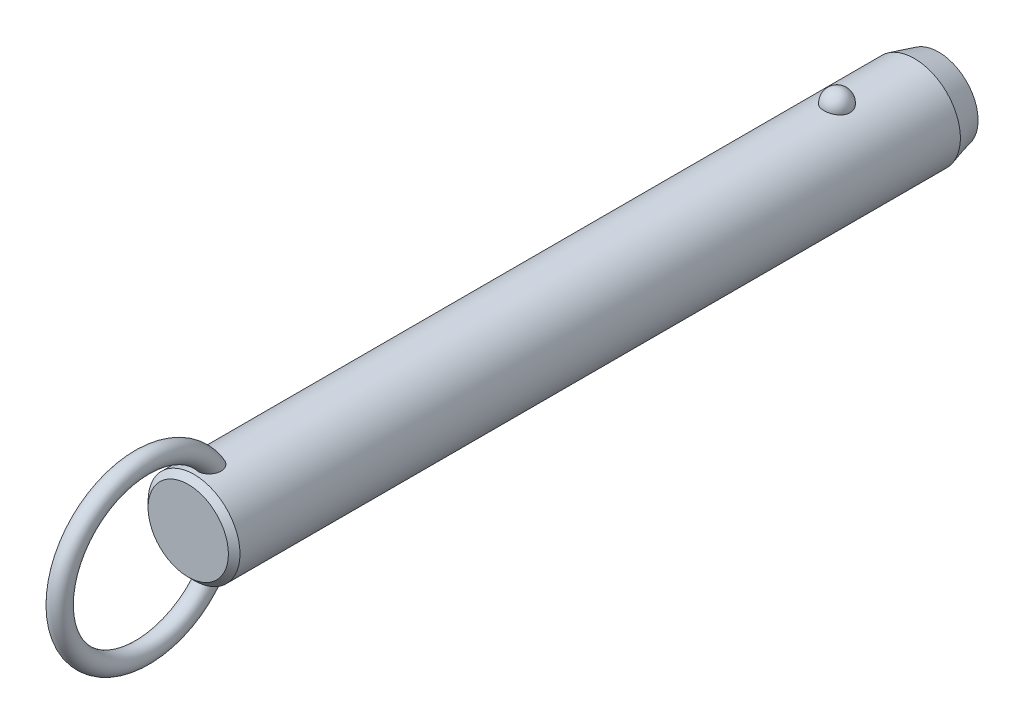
ISO-10303-21;
HEADER;
FILE_DESCRIPTION(('STEP AP214'),'2;1');
FILE_NAME('part.step','',(''),(''),'','','');
FILE_SCHEMA(('AUTOMOTIVE_DESIGN { 1 0 10303 214 1 1 1 1 }'));
ENDSEC;
DATA;
#1=APPLICATION_CONTEXT('core data for automotive mechanical design processes');
#2=APPLICATION_PROTOCOL_DEFINITION('international standard','automotive_design',2000,#1);
#3=PRODUCT_CONTEXT('',#1,'mechanical');
#4=PRODUCT('Part','Part','',(#3));
#5=PRODUCT_RELATED_PRODUCT_CATEGORY('part','',(#4));
#6=PRODUCT_DEFINITION_FORMATION('','',#4);
#7=PRODUCT_DEFINITION_CONTEXT('part definition',#1,'design');
#8=PRODUCT_DEFINITION('design','',#6,#7);
#9=PRODUCT_DEFINITION_SHAPE('','',#8);
#10=(LENGTH_UNIT() NAMED_UNIT(*) SI_UNIT(.MILLI.,.METRE.));
#11=(NAMED_UNIT(*) PLANE_ANGLE_UNIT() SI_UNIT($,.RADIAN.));
#12=(NAMED_UNIT(*) SI_UNIT($,.STERADIAN.) SOLID_ANGLE_UNIT());
#13=UNCERTAINTY_MEASURE_WITH_UNIT(LENGTH_MEASURE(1.E-05),#10,'distance_accuracy_value','');
#14=(GEOMETRIC_REPRESENTATION_CONTEXT(3) GLOBAL_UNCERTAINTY_ASSIGNED_CONTEXT((#13)) GLOBAL_UNIT_ASSIGNED_CONTEXT((#10,
#11,#12)) REPRESENTATION_CONTEXT('',''));
#15=CARTESIAN_POINT('',(0.,0.,0.));
#16=DIRECTION('',(0.,0.,1.));
#17=DIRECTION('',(1.,0.,0.));
#18=AXIS2_PLACEMENT_3D('',#15,#16,#17);
#19=CARTESIAN_POINT('',(0.,0.,121.9));
#20=DIRECTION('',(0.,0.,-1.));
#21=DIRECTION('',(-1.,0.,0.));
#22=AXIS2_PLACEMENT_3D('',#19,#20,#21);
#23=CYLINDRICAL_SURFACE('',#22,9.5);
#24=CARTESIAN_POINT('',(2.67259918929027,9.11631578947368,-2.70000000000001));
#25=CARTESIAN_POINT('',(2.6725968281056,9.11631786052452,-2.54909854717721));
#26=CARTESIAN_POINT('',(2.66030567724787,9.11994722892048,-2.39816735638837));
#27=CARTESIAN_POINT('',(2.6114347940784,9.13405924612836,-2.10058568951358));
#28=CARTESIAN_POINT('',(2.57484658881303,9.14454428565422,-1.95393672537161));
#29=CARTESIAN_POINT('',(2.47830875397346,9.17117631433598,-1.66916069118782));
#30=CARTESIAN_POINT('',(2.41836936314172,9.18732082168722,-1.53102991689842));
#31=CARTESIAN_POINT('',(2.27661331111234,9.22346780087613,-1.26705393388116));
#32=CARTESIAN_POINT('',(2.19479699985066,9.24347021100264,-1.14120852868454));
#33=CARTESIAN_POINT('',(2.01085282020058,9.28522401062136,-0.904632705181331));
#34=CARTESIAN_POINT('',(1.90862396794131,9.30698376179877,-0.793982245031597));
#35=CARTESIAN_POINT('',(1.6867437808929,9.34973971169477,-0.591607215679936));
#36=CARTESIAN_POINT('',(1.56709244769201,9.37073591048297,-0.499882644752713));
#37=CARTESIAN_POINT('',(1.31393976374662,9.40956370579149,-0.338167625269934));
#38=CARTESIAN_POINT('',(1.18048026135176,9.42740444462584,-0.268113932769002));
#39=CARTESIAN_POINT('',(0.903154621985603,9.45799906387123,-0.151390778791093));
#40=CARTESIAN_POINT('',(0.759289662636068,9.47075351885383,-0.104718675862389));
#41=CARTESIAN_POINT('',(0.468074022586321,9.48956256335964,-0.0367633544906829));
#42=CARTESIAN_POINT('',(0.320836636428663,9.49573643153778,-0.0150275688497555));
#43=CARTESIAN_POINT('',(0.0246714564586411,9.50112183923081,0.00396199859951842));
#44=CARTESIAN_POINT('',(-0.124256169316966,9.50033406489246,0.00121819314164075));
#45=CARTESIAN_POINT('',(-0.417264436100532,9.4919475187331,-0.0284441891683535));
#46=CARTESIAN_POINT('',(-0.56138413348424,9.48444885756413,-0.0550074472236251));
#47=CARTESIAN_POINT('',(-0.842986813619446,9.46357853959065,-0.131064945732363));
#48=CARTESIAN_POINT('',(-0.980469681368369,9.450206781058,-0.180559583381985));
#49=CARTESIAN_POINT('',(-1.24585005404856,9.41890822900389,-0.301476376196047));
#50=CARTESIAN_POINT('',(-1.37368611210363,9.40095498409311,-0.373026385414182));
#51=CARTESIAN_POINT('',(-1.61552738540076,9.36242964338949,-0.536025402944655));
#52=CARTESIAN_POINT('',(-1.72953116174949,9.34185727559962,-0.627476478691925));
#53=CARTESIAN_POINT('',(-1.9429225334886,9.29984568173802,-0.829844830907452));
#54=CARTESIAN_POINT('',(-2.04198021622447,9.27839736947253,-0.94110821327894));
#55=CARTESIAN_POINT('',(-2.22026460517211,9.23735994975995,-1.17883414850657));
#56=CARTESIAN_POINT('',(-2.29948985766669,9.21777097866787,-1.30529781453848));
#57=CARTESIAN_POINT('',(-2.43697287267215,9.18238994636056,-1.57158566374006));
#58=CARTESIAN_POINT('',(-2.49497068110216,9.16664569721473,-1.71155057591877));
#59=CARTESIAN_POINT('',(-2.5872073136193,9.14104303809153,-1.99961197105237));
#60=CARTESIAN_POINT('',(-2.62144683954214,9.13118445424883,-2.14770821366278));
#61=CARTESIAN_POINT('',(-2.66521466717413,9.11850622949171,-2.44715424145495));
#62=CARTESIAN_POINT('',(-2.67484831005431,9.11565658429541,-2.59848735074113));
#63=CARTESIAN_POINT('',(-2.66946735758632,9.11723375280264,-2.90067317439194));
#64=CARTESIAN_POINT('',(-2.65445345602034,9.12166036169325,-3.05152590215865));
#65=CARTESIAN_POINT('',(-2.60029711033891,9.13724422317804,-3.34766110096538));
#66=CARTESIAN_POINT('',(-2.56127978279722,9.14836656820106,-3.49296833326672));
#67=CARTESIAN_POINT('',(-2.46018844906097,9.17606676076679,-3.77477535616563));
#68=CARTESIAN_POINT('',(-2.39811349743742,9.1926448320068,-3.9112747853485));
#69=CARTESIAN_POINT('',(-2.25202303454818,9.22952198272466,-4.17244273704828));
#70=CARTESIAN_POINT('',(-2.16788714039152,9.24984129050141,-4.29704106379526));
#71=CARTESIAN_POINT('',(-1.9799408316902,9.29188255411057,-4.53013066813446));
#72=CARTESIAN_POINT('',(-1.87612963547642,9.31360456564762,-4.63862130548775));
#73=CARTESIAN_POINT('',(-1.65105429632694,9.35612959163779,-4.8369029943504));
#74=CARTESIAN_POINT('',(-1.52972405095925,9.37692871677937,-4.92661991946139));
#75=CARTESIAN_POINT('',(-1.27318250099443,9.41518970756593,-5.08429106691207));
#76=CARTESIAN_POINT('',(-1.13797219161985,9.432651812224,-5.15224684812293));
#77=CARTESIAN_POINT('',(-0.859280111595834,9.46208255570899,-5.26371827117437));
#78=CARTESIAN_POINT('',(-0.715925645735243,9.47411833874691,-5.30753421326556));
#79=CARTESIAN_POINT('',(-0.423550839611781,9.4916822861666,-5.37076321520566));
#80=CARTESIAN_POINT('',(-0.2745312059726,9.49721125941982,-5.39017930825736));
#81=CARTESIAN_POINT('',(0.0218446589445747,9.50110860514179,-5.40390587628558));
#82=CARTESIAN_POINT('',(0.16917707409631,9.49961381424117,-5.39869609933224));
#83=CARTESIAN_POINT('',(0.460808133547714,9.48993906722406,-5.36441955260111));
#84=CARTESIAN_POINT('',(0.605106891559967,9.48175936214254,-5.33535367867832));
#85=CARTESIAN_POINT('',(0.886027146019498,9.4596376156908,-5.25435587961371));
#86=CARTESIAN_POINT('',(1.02267710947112,9.44571881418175,-5.20251612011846));
#87=CARTESIAN_POINT('',(1.28523827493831,9.41358993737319,-5.07741549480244));
#88=CARTESIAN_POINT('',(1.41114877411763,9.39537958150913,-5.00415322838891));
#89=CARTESIAN_POINT('',(1.65085227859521,9.3562644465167,-4.83684599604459));
#90=CARTESIAN_POINT('',(1.76442346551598,9.33532178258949,-4.74249218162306));
#91=CARTESIAN_POINT('',(1.97425672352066,9.29321198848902,-4.53620389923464));
#92=CARTESIAN_POINT('',(2.07051582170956,9.27204482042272,-4.42426641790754));
#93=CARTESIAN_POINT('',(2.24490086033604,9.23139221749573,-4.18363183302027));
#94=CARTESIAN_POINT('',(2.32267019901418,9.21194380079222,-4.05466990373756));
#95=CARTESIAN_POINT('',(2.45584092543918,9.1773419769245,-3.78517836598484));
#96=CARTESIAN_POINT('',(2.5112497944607,9.16218713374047,-3.64465264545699));
#97=CARTESIAN_POINT('',(2.59380876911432,9.13913522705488,-3.37104301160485));
#98=CARTESIAN_POINT('',(2.62330266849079,9.13064624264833,-3.23871053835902));
#99=CARTESIAN_POINT('',(2.66269870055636,9.11923566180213,-2.97092664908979));
#100=CARTESIAN_POINT('',(2.67260130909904,9.11631393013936,-2.83547530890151));
#101=CARTESIAN_POINT('',(2.67259918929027,9.11631578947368,-2.70000000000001));
#102=B_SPLINE_CURVE_WITH_KNOTS('',3,(#24,#25,#26,#27,#28,#29,#30,#31,#32,#33,#34,#35,#36,#37,
#38,#39,#40,#41,#42,#43,#44,#45,#46,#47,#48,#49,#50,#51,#52,#53,#54,#55,#56,#57,#58,#59,#60,#61,
#62,#63,#64,#65,#66,#67,#68,#69,#70,#71,#72,#73,#74,#75,#76,#77,#78,#79,#80,#81,#82,#83,#84,#85,
#86,#87,#88,#89,#90,#91,#92,#93,#94,#95,#96,#97,#98,#99,#100,#101),.UNSPECIFIED.,.T.,.F.,(4,2,2,
2,2,2,2,2,2,2,2,2,2,2,2,2,2,2,2,2,2,2,2,2,2,2,2,2,2,2,2,2,2,2,2,2,2,2,4),(0.,0.452217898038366,
0.904593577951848,1.35677112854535,1.80894144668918,2.26340676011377,2.71787203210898,
3.17099820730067,3.62407318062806,4.0687883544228,4.51345969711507,4.95160616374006,
5.38976021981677,5.83050358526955,6.27129275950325,6.72071308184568,7.17016633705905,
7.62495278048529,8.07972578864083,8.53254856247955,8.98535859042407,9.43582813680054,
9.88631615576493,10.3393155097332,10.7923328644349,11.2471065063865,11.7018475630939,
12.150795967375,12.599688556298,13.0398725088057,13.4800399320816,13.9184421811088,
14.3568730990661,14.802202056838,15.2476074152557,15.7010097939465,16.1542603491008,
16.5602594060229,16.966248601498),.UNSPECIFIED.);
#103=CARTESIAN_POINT('',(2.67259918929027,9.11631578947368,-2.70000000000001));
#104=VERTEX_POINT('',#103);
#105=EDGE_CURVE('E41',#104,#104,#102,.T.);
#106=ORIENTED_EDGE('',*,*,#105,.T.);
#107=EDGE_LOOP('',(#106));
#108=FACE_BOUND('',#107,.T.);
#109=CARTESIAN_POINT('',(0.,0.,130.22));
#110=DIRECTION('',(0.,0.,1.));
#111=DIRECTION('',(1.,0.,0.));
#112=AXIS2_PLACEMENT_3D('',#109,#110,#111);
#113=CIRCLE('',#112,9.5);
#114=CARTESIAN_POINT('',(9.5,0.,130.22));
#115=VERTEX_POINT('',#114);
#116=EDGE_CURVE('E10',#115,#115,#113,.F.);
#117=ORIENTED_EDGE('',*,*,#116,.T.);
#118=EDGE_LOOP('',(#117));
#119=FACE_BOUND('',#118,.T.);
#120=CARTESIAN_POINT('',(-0.697062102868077,-9.47439269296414,124.567808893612));
#121=CARTESIAN_POINT('',(-0.799579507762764,-9.46685146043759,124.607482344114));
#122=CARTESIAN_POINT('',(-0.89857563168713,-9.45788043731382,124.6559309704));
#123=CARTESIAN_POINT('',(-1.08670047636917,-9.43811593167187,124.768868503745));
#124=CARTESIAN_POINT('',(-1.1758320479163,-9.42732297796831,124.833352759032));
#125=CARTESIAN_POINT('',(-1.34179806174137,-9.40513672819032,124.976209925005));
#126=CARTESIAN_POINT('',(-1.41865133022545,-9.39374438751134,125.054561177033));
#127=CARTESIAN_POINT('',(-1.55860047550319,-9.37154196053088,125.222752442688));
#128=CARTESIAN_POINT('',(-1.62169476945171,-9.3607319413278,125.31259377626));
#129=CARTESIAN_POINT('',(-1.73527695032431,-9.34035749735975,125.504500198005));
#130=CARTESIAN_POINT('',(-1.78522266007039,-9.33085270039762,125.606891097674));
#131=CARTESIAN_POINT('',(-1.86924997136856,-9.3143834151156,125.818148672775));
#132=CARTESIAN_POINT('',(-1.90332570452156,-9.30741986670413,125.927017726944));
#133=CARTESIAN_POINT('',(-1.95893603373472,-9.29588482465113,126.160473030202));
#134=CARTESIAN_POINT('',(-1.97872420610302,-9.29165182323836,126.285489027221));
#135=CARTESIAN_POINT('',(-2.00062129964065,-9.28695978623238,126.537080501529));
#136=CARTESIAN_POINT('',(-2.00272284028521,-9.28650232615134,126.663656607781));
#137=CARTESIAN_POINT('',(-1.98958876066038,-9.28932750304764,126.936815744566));
#138=CARTESIAN_POINT('',(-1.97143366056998,-9.2932400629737,127.083251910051));
#139=CARTESIAN_POINT('',(-1.91479925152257,-9.30507151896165,127.372062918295));
#140=CARTESIAN_POINT('',(-1.87629122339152,-9.31299607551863,127.514431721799));
#141=CARTESIAN_POINT('',(-1.7722568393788,-9.33340232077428,127.815172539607));
#142=CARTESIAN_POINT('',(-1.70334898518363,-9.34641636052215,127.972369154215));
#143=CARTESIAN_POINT('',(-1.58111062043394,-9.36759153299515,128.197517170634));
#144=CARTESIAN_POINT('',(-1.53721459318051,-9.37492619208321,128.270796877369));
#145=CARTESIAN_POINT('',(-1.44302631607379,-9.38988566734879,128.41307405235));
#146=CARTESIAN_POINT('',(-1.39273721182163,-9.39751033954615,128.482073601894));
#147=CARTESIAN_POINT('',(-1.26775962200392,-9.41530678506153,128.636983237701));
#148=CARTESIAN_POINT('',(-1.19052326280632,-9.42548108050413,128.720871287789));
#149=CARTESIAN_POINT('',(-1.02420241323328,-9.44499825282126,128.876008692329));
#150=CARTESIAN_POINT('',(-0.935139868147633,-9.45434261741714,128.947280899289));
#151=CARTESIAN_POINT('',(-0.766610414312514,-9.46930670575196,129.058695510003));
#152=CARTESIAN_POINT('',(-0.689439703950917,-9.47529223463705,129.102235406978));
#153=CARTESIAN_POINT('',(-0.52894200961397,-9.48560294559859,129.17631336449));
#154=CARTESIAN_POINT('',(-0.445620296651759,-9.48992953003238,129.206862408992));
#155=CARTESIAN_POINT('',(-0.273901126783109,-9.49644161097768,129.252579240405));
#156=CARTESIAN_POINT('',(-0.185465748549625,-9.49860811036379,129.26761059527));
#157=CARTESIAN_POINT('',(-0.00734541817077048,-9.5004135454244,129.280149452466));
#158=CARTESIAN_POINT('',(0.0823387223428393,-9.50005405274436,129.277667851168));
#159=CARTESIAN_POINT('',(0.247679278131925,-9.49708301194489,129.256995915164));
#160=CARTESIAN_POINT('',(0.323620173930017,-9.49477609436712,129.240930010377));
#161=CARTESIAN_POINT('',(0.471981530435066,-9.48855917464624,129.197172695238));
#162=CARTESIAN_POINT('',(0.544400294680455,-9.48464840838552,129.169475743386));
#163=CARTESIAN_POINT('',(0.708947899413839,-9.47398336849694,129.09280266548));
#164=CARTESIAN_POINT('',(0.799149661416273,-9.46671310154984,129.039774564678));
#165=CARTESIAN_POINT('',(0.969783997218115,-9.4507622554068,128.919973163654));
#166=CARTESIAN_POINT('',(1.05019415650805,-9.44207854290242,128.853169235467));
#167=CARTESIAN_POINT('',(1.23092343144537,-9.42051459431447,128.680759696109));
#168=CARTESIAN_POINT('',(1.32652499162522,-9.40733378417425,128.57026193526));
#169=CARTESIAN_POINT('',(1.49893121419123,-9.38140745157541,128.335561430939));
#170=CARTESIAN_POINT('',(1.57571616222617,-9.36866239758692,128.211344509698));
#171=CARTESIAN_POINT('',(1.71285426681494,-9.34457644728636,127.949389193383));
#172=CARTESIAN_POINT('',(1.77266365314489,-9.33328726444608,127.81136233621));
#173=CARTESIAN_POINT('',(1.87239208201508,-9.31379209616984,127.528051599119));
#174=CARTESIAN_POINT('',(1.91230158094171,-9.3055875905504,127.382764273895));
#175=CARTESIAN_POINT('',(1.97604189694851,-9.29228394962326,127.062028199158));
#176=CARTESIAN_POINT('',(1.99587438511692,-9.28797202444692,126.885724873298));
#177=CARTESIAN_POINT('',(2.0029570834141,-9.28645519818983,126.532414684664));
#178=CARTESIAN_POINT('',(1.99025930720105,-9.28923895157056,126.355409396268));
#179=CARTESIAN_POINT('',(1.93735479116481,-9.30038134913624,126.056338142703));
#180=CARTESIAN_POINT('',(1.90576827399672,-9.30697680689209,125.932667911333));
#181=CARTESIAN_POINT('',(1.82287484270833,-9.32356855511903,125.692329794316));
#182=CARTESIAN_POINT('',(1.77158213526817,-9.33356239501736,125.575656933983));
#183=CARTESIAN_POINT('',(1.64885744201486,-9.35602275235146,125.352706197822));
#184=CARTESIAN_POINT('',(1.57730995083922,-9.36850332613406,125.246492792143));
#185=CARTESIAN_POINT('',(1.41543264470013,-9.39431873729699,125.049553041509));
#186=CARTESIAN_POINT('',(1.32510883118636,-9.40765330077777,124.958821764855));
#187=CARTESIAN_POINT('',(1.1384622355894,-9.43195720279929,124.805033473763));
#188=CARTESIAN_POINT('',(1.04369890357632,-9.44302894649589,124.740094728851));
#189=CARTESIAN_POINT('',(0.843965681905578,-9.46296805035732,124.628038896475));
#190=CARTESIAN_POINT('',(0.739000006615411,-9.4718363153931,124.580914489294));
#191=CARTESIAN_POINT('',(0.528175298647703,-9.48586140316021,124.508117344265));
#192=CARTESIAN_POINT('',(0.422686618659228,-9.49119633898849,124.48140249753));
#193=CARTESIAN_POINT('',(0.208590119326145,-9.49831365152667,124.446013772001));
#194=CARTESIAN_POINT('',(0.0999817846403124,-9.500095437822,124.437342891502));
#195=CARTESIAN_POINT('',(-0.126104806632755,-9.49988861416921,124.438350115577));
#196=CARTESIAN_POINT('',(-0.243578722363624,-9.49757821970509,124.449594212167));
#197=CARTESIAN_POINT('',(-0.474390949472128,-9.48885165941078,124.493167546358));
#198=CARTESIAN_POINT('',(-0.587729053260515,-9.48243528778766,124.525497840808));
#199=CARTESIAN_POINT('',(-0.697062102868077,-9.47439269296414,124.567808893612));
#200=B_SPLINE_CURVE_WITH_KNOTS('',3,(#120,#121,#122,#123,#124,#125,#126,#127,#128,#129,#130,
#131,#132,#133,#134,#135,#136,#137,#138,#139,#140,#141,#142,#143,#144,#145,#146,#147,#148,#149,
#150,#151,#152,#153,#154,#155,#156,#157,#158,#159,#160,#161,#162,#163,#164,#165,#166,#167,#168,
#169,#170,#171,#172,#173,#174,#175,#176,#177,#178,#179,#180,#181,#182,#183,#184,#185,#186,#187,
#188,#189,#190,#191,#192,#193,#194,#195,#196,#197,#198,#199),.UNSPECIFIED.,.T.,.F.,(4,2,2,2,2,2,
2,2,2,2,2,2,2,2,2,2,2,2,2,2,2,2,2,2,2,2,2,2,2,2,2,2,2,2,2,2,2,2,2,4),(0.,0.330119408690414,
0.660143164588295,0.989655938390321,1.31920659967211,1.66074728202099,2.0024141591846,
2.38088696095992,2.75951768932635,3.20065679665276,3.64242004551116,4.15620996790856,
4.41314162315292,4.66994734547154,5.01228664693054,5.3539993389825,5.61943037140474,
5.88463652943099,6.15215502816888,6.41950709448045,6.6514439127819,6.88349136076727,
7.19641200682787,7.51003602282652,7.94779711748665,8.38601491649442,8.83699707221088,
9.28819530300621,9.817786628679,10.3465317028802,10.7284172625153,11.1100280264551,
11.4938603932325,11.8775702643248,12.2220189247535,12.5663259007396,12.8915939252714,
13.2169159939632,13.5689650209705,13.9210316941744),.UNSPECIFIED.);
#201=CARTESIAN_POINT('',(-0.697062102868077,-9.47439269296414,124.567808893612));
#202=VERTEX_POINT('',#201);
#203=EDGE_CURVE('E60',#202,#202,#200,.T.);
#204=ORIENTED_EDGE('',*,*,#203,.T.);
#205=EDGE_LOOP('',(#204));
#206=FACE_BOUND('',#205,.T.);
#207=CARTESIAN_POINT('',(-0.697062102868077,9.47439269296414,124.567808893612));
#208=CARTESIAN_POINT('',(-0.597792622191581,9.48169483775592,124.52939564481));
#209=CARTESIAN_POINT('',(-0.495106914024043,9.48766580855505,124.499168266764));
#210=CARTESIAN_POINT('',(-0.285876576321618,9.49627648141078,124.456032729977));
#211=CARTESIAN_POINT('',(-0.179324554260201,9.49890941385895,124.443159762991));
#212=CARTESIAN_POINT('',(0.0344157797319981,9.50053798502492,124.435166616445));
#213=CARTESIAN_POINT('',(0.141603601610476,9.49953613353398,124.440034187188));
#214=CARTESIAN_POINT('',(0.353563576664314,9.49401038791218,124.467365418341));
#215=CARTESIAN_POINT('',(0.45833679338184,9.48948807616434,124.48982117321));
#216=CARTESIAN_POINT('',(0.662493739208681,9.4774236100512,124.551671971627));
#217=CARTESIAN_POINT('',(0.761881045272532,9.46988348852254,124.591055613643));
#218=CARTESIAN_POINT('',(0.952608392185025,9.45260382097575,124.685634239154));
#219=CARTESIAN_POINT('',(1.04394806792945,9.44286417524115,124.740829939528));
#220=CARTESIAN_POINT('',(1.21712767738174,9.4221176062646,124.866066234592));
#221=CARTESIAN_POINT('',(1.29885671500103,9.41109835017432,124.936257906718));
#222=CARTESIAN_POINT('',(1.4497897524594,9.38903310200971,125.088980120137));
#223=CARTESIAN_POINT('',(1.51899278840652,9.37798710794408,125.171511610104));
#224=CARTESIAN_POINT('',(1.64602857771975,9.35654375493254,125.349776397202));
#225=CARTESIAN_POINT('',(1.70333052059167,9.34618688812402,125.445891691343));
#226=CARTESIAN_POINT('',(1.80259341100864,9.32755128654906,125.645897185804));
#227=CARTESIAN_POINT('',(1.84454942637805,9.31927322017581,125.749789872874));
#228=CARTESIAN_POINT('',(1.91637039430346,9.30478365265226,125.972213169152));
#229=CARTESIAN_POINT('',(1.94480547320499,9.29882552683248,126.091219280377));
#230=CARTESIAN_POINT('',(1.98449865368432,9.29043398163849,126.332143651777));
#231=CARTESIAN_POINT('',(1.99574908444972,9.28800213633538,126.454063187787));
#232=CARTESIAN_POINT('',(2.00275141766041,9.28649645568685,126.716932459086));
#233=CARTESIAN_POINT('',(1.99588238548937,9.28799035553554,126.857952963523));
#234=CARTESIAN_POINT('',(1.96270559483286,9.29505517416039,127.137621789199));
#235=CARTESIAN_POINT('',(1.93637872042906,9.30063010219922,127.276267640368));
#236=CARTESIAN_POINT('',(1.85949176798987,9.31633564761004,127.572561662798));
#237=CARTESIAN_POINT('',(1.80549792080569,9.3270926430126,127.729290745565));
#238=CARTESIAN_POINT('',(1.67376869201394,9.3516306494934,128.032284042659));
#239=CARTESIAN_POINT('',(1.59603181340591,9.36541185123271,128.178547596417));
#240=CARTESIAN_POINT('',(1.4360277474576,9.39110706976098,128.425813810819));
#241=CARTESIAN_POINT('',(1.35831795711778,9.40278656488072,128.529791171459));
#242=CARTESIAN_POINT('',(1.18774483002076,9.42585025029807,128.724534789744));
#243=CARTESIAN_POINT('',(1.09490932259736,9.43723493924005,128.815324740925));
#244=CARTESIAN_POINT('',(0.921110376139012,9.45552616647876,128.95620334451));
#245=CARTESIAN_POINT('',(0.843738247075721,9.46281058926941,129.010656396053));
#246=CARTESIAN_POINT('',(0.681245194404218,9.47589120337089,129.106711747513));
#247=CARTESIAN_POINT('',(0.596135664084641,9.48168953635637,129.148332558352));
#248=CARTESIAN_POINT('',(0.433779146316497,9.49038144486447,129.210089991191));
#249=CARTESIAN_POINT('',(0.357459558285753,9.49359170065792,129.23260136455));
#250=CARTESIAN_POINT('',(0.202074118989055,9.49816761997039,129.264574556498));
#251=CARTESIAN_POINT('',(0.123010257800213,9.49953459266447,129.274045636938));
#252=CARTESIAN_POINT('',(-0.0357372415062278,9.50026497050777,129.279114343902));
#253=CARTESIAN_POINT('',(-0.115421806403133,9.49962433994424,129.274684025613));
#254=CARTESIAN_POINT('',(-0.272823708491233,9.49640854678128,129.252296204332));
#255=CARTESIAN_POINT('',(-0.350540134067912,9.4938325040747,129.234332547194));
#256=CARTESIAN_POINT('',(-0.500580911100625,9.48709462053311,129.186802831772));
#257=CARTESIAN_POINT('',(-0.572979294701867,9.48296359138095,129.157461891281));
#258=CARTESIAN_POINT('',(-0.71286452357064,9.47347609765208,129.089008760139));
#259=CARTESIAN_POINT('',(-0.780349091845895,9.46811906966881,129.049892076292));
#260=CARTESIAN_POINT('',(-0.946309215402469,9.45329720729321,128.939432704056));
#261=CARTESIAN_POINT('',(-1.04090230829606,9.44321512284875,128.862329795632));
#262=CARTESIAN_POINT('',(-1.21661929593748,9.42219227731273,128.69409718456));
#263=CARTESIAN_POINT('',(-1.29770519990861,9.41124921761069,128.602929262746));
#264=CARTESIAN_POINT('',(-1.47319646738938,9.38563439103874,128.376162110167));
#265=CARTESIAN_POINT('',(-1.56208878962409,9.37102009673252,128.236289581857));
#266=CARTESIAN_POINT('',(-1.71623987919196,9.34401559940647,127.943950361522));
#267=CARTESIAN_POINT('',(-1.78147866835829,9.33162728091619,127.791473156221));
#268=CARTESIAN_POINT('',(-1.88853837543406,9.31055541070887,127.475647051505));
#269=CARTESIAN_POINT('',(-1.92998995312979,9.30193076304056,127.312168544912));
#270=CARTESIAN_POINT('',(-1.98590726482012,9.29015757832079,126.980526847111));
#271=CARTESIAN_POINT('',(-2.0004070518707,9.2870021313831,126.812369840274));
#272=CARTESIAN_POINT('',(-1.99964701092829,9.28716218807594,126.505080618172));
#273=CARTESIAN_POINT('',(-1.98908145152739,9.28945704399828,126.365936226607));
#274=CARTESIAN_POINT('',(-1.94566294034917,9.29865169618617,126.091153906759));
#275=CARTESIAN_POINT('',(-1.91282062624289,9.30554929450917,125.955514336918));
#276=CARTESIAN_POINT('',(-1.84582133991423,9.31898248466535,125.757802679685));
#277=CARTESIAN_POINT('',(-1.82038084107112,9.32400364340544,125.692583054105));
#278=CARTESIAN_POINT('',(-1.76350511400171,9.33492884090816,125.564903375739));
#279=CARTESIAN_POINT('',(-1.73207305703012,9.34083241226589,125.502441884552));
#280=CARTESIAN_POINT('',(-1.6632424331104,9.35333332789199,125.38094078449));
#281=CARTESIAN_POINT('',(-1.625842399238,9.35993084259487,125.321902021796));
#282=CARTESIAN_POINT('',(-1.54527678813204,9.37356864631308,125.207987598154));
#283=CARTESIAN_POINT('',(-1.50211241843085,9.38060884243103,125.153111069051));
#284=CARTESIAN_POINT('',(-1.37681147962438,9.40004442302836,125.009961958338));
#285=CARTESIAN_POINT('',(-1.28916358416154,9.41261047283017,124.926429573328));
#286=CARTESIAN_POINT('',(-1.09996826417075,9.43658180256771,124.777236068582));
#287=CARTESIAN_POINT('',(-0.998461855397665,9.44799034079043,124.711523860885));
#288=CARTESIAN_POINT('',(-0.86018898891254,9.46103017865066,124.6394367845));
#289=CARTESIAN_POINT('',(-0.828141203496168,9.46389141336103,124.623851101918));
#290=CARTESIAN_POINT('',(-0.763210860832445,9.46934915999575,124.594473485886));
#291=CARTESIAN_POINT('',(-0.730328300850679,9.47194567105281,124.580681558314));
#292=CARTESIAN_POINT('',(-0.697062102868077,9.47439269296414,124.567808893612));
#293=B_SPLINE_CURVE_WITH_KNOTS('',3,(#207,#208,#209,#210,#211,#212,#213,#214,#215,#216,#217,
#218,#219,#220,#221,#222,#223,#224,#225,#226,#227,#228,#229,#230,#231,#232,#233,#234,#235,#236,
#237,#238,#239,#240,#241,#242,#243,#244,#245,#246,#247,#248,#249,#250,#251,#252,#253,#254,#255,
#256,#257,#258,#259,#260,#261,#262,#263,#264,#265,#266,#267,#268,#269,#270,#271,#272,#273,#274,
#275,#276,#277,#278,#279,#280,#281,#282,#283,#284,#285,#286,#287,#288,#289,#290,#291,#292),
.UNSPECIFIED.,.T.,.F.,(4,2,2,2,2,2,2,2,2,2,2,2,2,2,2,2,2,2,2,2,2,2,2,2,2,2,2,2,2,2,2,2,2,2,2,2,
2,2,2,2,2,2,4),(0.,0.319942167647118,0.640532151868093,0.960900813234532,1.28112555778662,
1.60113495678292,1.92115886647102,2.24457323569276,2.56801248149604,2.90371927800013,
3.23953387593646,3.6056031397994,3.97183576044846,4.39383693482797,4.81625324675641,
5.31257045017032,5.80891895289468,6.19868344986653,6.5877387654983,6.87145417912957,
7.15475838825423,7.3926375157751,7.63034760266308,7.86853584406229,8.10683246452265,
8.34063661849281,8.57454843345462,8.93983939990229,9.30614105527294,9.80266668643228,
10.2996107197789,10.8040753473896,11.3079021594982,11.7249776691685,12.1418541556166,
12.3521485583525,12.5623319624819,12.7725671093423,12.9827582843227,13.345827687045,
13.7078449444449,13.8150604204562,13.9222762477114),.UNSPECIFIED.);
#294=CARTESIAN_POINT('',(-0.697062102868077,9.47439269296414,124.567808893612));
#295=VERTEX_POINT('',#294);
#296=EDGE_CURVE('E67',#295,#295,#293,.T.);
#297=ORIENTED_EDGE('',*,*,#296,.T.);
#298=EDGE_LOOP('',(#297));
#299=FACE_BOUND('',#298,.T.);
#300=CARTESIAN_POINT('',(0.,0.,-18.6999999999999));
#301=DIRECTION('',(0.,0.,-1.));
#302=DIRECTION('',(-1.,0.,0.));
#303=AXIS2_PLACEMENT_3D('',#300,#301,#302);
#304=CIRCLE('',#303,9.5);
#305=CARTESIAN_POINT('',(-9.5,0.,-18.6999999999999));
#306=VERTEX_POINT('',#305);
#307=EDGE_CURVE('E57',#306,#306,#304,.F.);
#308=ORIENTED_EDGE('',*,*,#307,.T.);
#309=EDGE_LOOP('',(#308));
#310=FACE_BOUND('',#309,.T.);
#311=ADVANCED_FACE('F37',(#108,#119,#206,#299,#310),#23,.T.);
#312=CARTESIAN_POINT('',(0.,0.,-23.7));
#313=DIRECTION('',(0.,0.,-1.));
#314=DIRECTION('',(-1.,0.,0.));
#315=AXIS2_PLACEMENT_3D('',#312,#313,#314);
#316=PLANE('',#315);
#317=CARTESIAN_POINT('',(0.,0.,-23.7));
#318=DIRECTION('',(0.,0.,-1.));
#319=DIRECTION('',(-1.,0.,0.));
#320=AXIS2_PLACEMENT_3D('',#317,#318,#319);
#321=CIRCLE('',#320,8.16025403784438);
#322=CARTESIAN_POINT('',(-8.16025403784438,0.,-23.7));
#323=VERTEX_POINT('',#322);
#324=EDGE_CURVE('E66',#323,#323,#321,.T.);
#325=ORIENTED_EDGE('',*,*,#324,.T.);
#326=EDGE_LOOP('',(#325));
#327=FACE_BOUND('',#326,.T.);
#328=ADVANCED_FACE('F85',(#327),#316,.T.);
#329=CARTESIAN_POINT('',(0.,0.,-23.7));
#330=DIRECTION('',(0.,0.,1.));
#331=DIRECTION('',(1.,0.,0.));
#332=AXIS2_PLACEMENT_3D('',#329,#330,#331);
#333=CONICAL_SURFACE('',#332,8.16025403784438,0.261799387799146);
#334=ORIENTED_EDGE('',*,*,#307,.F.);
#335=EDGE_LOOP('',(#334));
#336=FACE_BOUND('',#335,.T.);
#337=ORIENTED_EDGE('',*,*,#324,.F.);
#338=EDGE_LOOP('',(#337));
#339=FACE_BOUND('',#338,.T.);
#340=ADVANCED_FACE('F83',(#336,#339),#333,.T.);
#341=CARTESIAN_POINT('',(0.,0.,131.42));
#342=DIRECTION('',(0.,0.,1.));
#343=DIRECTION('',(1.,0.,0.));
#344=AXIS2_PLACEMENT_3D('',#341,#342,#343);
#345=PLANE('',#344);
#346=CARTESIAN_POINT('',(0.,0.,131.42));
#347=DIRECTION('',(0.,0.,1.));
#348=DIRECTION('',(1.,0.,0.));
#349=AXIS2_PLACEMENT_3D('',#346,#347,#348);
#350=CIRCLE('',#349,8.3);
#351=CARTESIAN_POINT('',(8.3,0.,131.42));
#352=VERTEX_POINT('',#351);
#353=EDGE_CURVE('E50',#352,#352,#350,.T.);
#354=ORIENTED_EDGE('',*,*,#353,.T.);
#355=EDGE_LOOP('',(#354));
#356=FACE_BOUND('',#355,.T.);
#357=ADVANCED_FACE('F77',(#356),#345,.T.);
#358=CARTESIAN_POINT('',(0.,0.,140.95));
#359=DIRECTION('',(1.,0.,0.));
#360=DIRECTION('',(0.,0.,-1.));
#361=AXIS2_PLACEMENT_3D('',#358,#359,#360);
#362=TOROIDAL_SURFACE('',#361,17.05,2.);
#363=ORIENTED_EDGE('',*,*,#296,.F.);
#364=EDGE_LOOP('',(#363));
#365=FACE_BOUND('',#364,.T.);
#366=ORIENTED_EDGE('',*,*,#203,.F.);
#367=EDGE_LOOP('',(#366));
#368=FACE_BOUND('',#367,.T.);
#369=ADVANCED_FACE('F73',(#365,#368),#362,.T.);
#370=CARTESIAN_POINT('',(0.,0.,131.42));
#371=DIRECTION('',(0.,0.,-1.));
#372=DIRECTION('',(-1.,0.,0.));
#373=AXIS2_PLACEMENT_3D('',#370,#371,#372);
#374=CONICAL_SURFACE('',#373,8.3,0.785398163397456);
#375=ORIENTED_EDGE('',*,*,#116,.F.);
#376=EDGE_LOOP('',(#375));
#377=FACE_BOUND('',#376,.T.);
#378=ORIENTED_EDGE('',*,*,#353,.F.);
#379=EDGE_LOOP('',(#378));
#380=FACE_BOUND('',#379,.T.);
#381=ADVANCED_FACE('F39',(#377,#380),#374,.T.);
#382=CARTESIAN_POINT('',(0.,9.5,-2.70000000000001));
#383=DIRECTION('',(0.,1.,0.));
#384=DIRECTION('',(0.,0.,-1.));
#385=AXIS2_PLACEMENT_3D('',#382,#383,#384);
#386=SPHERICAL_SURFACE('',#385,2.7);
#387=ORIENTED_EDGE('',*,*,#105,.F.);
#388=EDGE_LOOP('',(#387));
#389=FACE_BOUND('',#388,.T.);
#390=ADVANCED_FACE('F79',(#389),#386,.T.);
#391=CLOSED_SHELL('',(#311,#328,#340,#357,#369,#381,#390));
#392=MANIFOLD_SOLID_BREP('B2',#391);
#393=ADVANCED_BREP_SHAPE_REPRESENTATION('',(#18,#392),#14);
#394=SHAPE_DEFINITION_REPRESENTATION(#9,#393);
ENDSEC;
END-ISO-10303-21;
